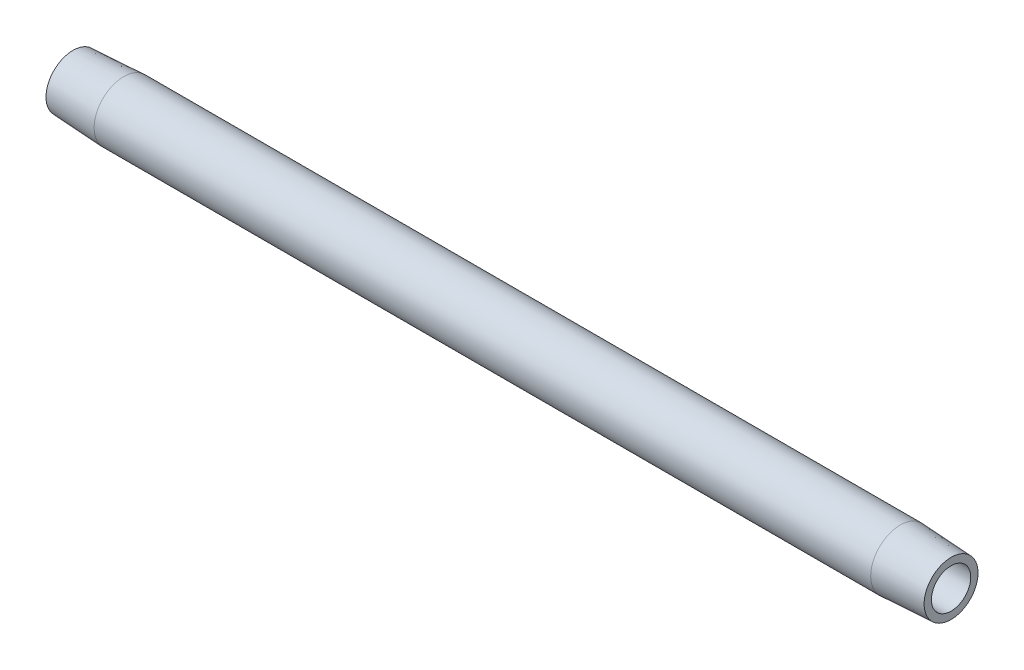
from build123d import *


with BuildPart() as part:
    # Sketch2 → Revolve1 (revolve)
    with BuildSketch(Plane.XY, mode=Mode.PRIVATE) as revolve1_sk:
        Polygon((8.810039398, 5.1435), (0, 4.6817854), (0, 3.4163), (152.4, 3.4163), (152.4, 4.6817854), (143.589960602, 5.1435), align=None)
    revolve(revolve1_sk.sketch.rotate(Axis((0.476141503, 0, 0), (1, 0, 0)), 90), axis=Axis((0.476141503, 0, 0), (1, 0, 0)))


solid = part.part
